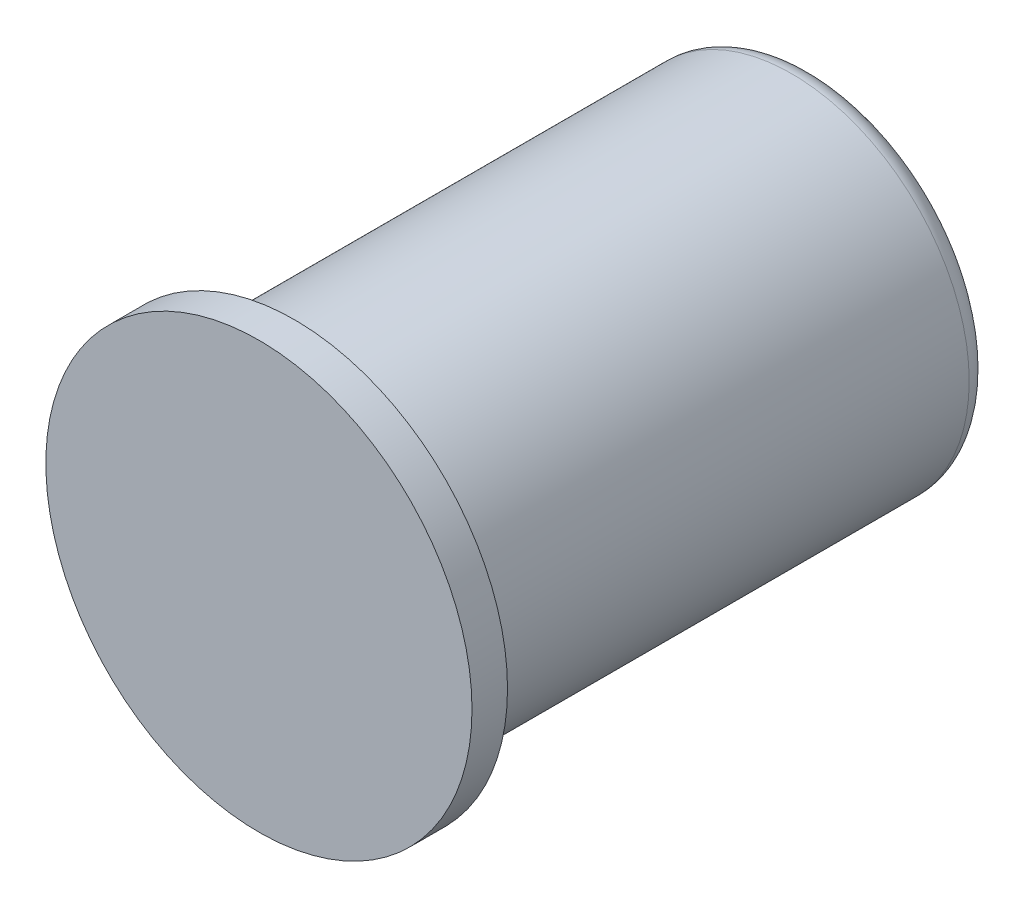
from build123d import *


with BuildPart() as part:
    # Sketch1 → Revolve1 (revolve)
    with BuildSketch(Plane(origin=(0, 0, 0), x_dir=(0, 0, -1), z_dir=(1, 0, 0)), mode=Mode.PRIVATE) as revolve1_sk:
        with BuildLine():
            Line((0, 0), (0, 30))
            Line((0, 30), (5, 30))
            Line((5, 30), (5, 25))
            Line((5, 25), (75, 25))
            ThreePointArc((75, 25), (77.121320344, 24.121320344), (78, 22))
            Line((78, 22), (78, 4.5))
            Line((78, 4.5), (77.5, 4))
            Line((77.5, 4), (69, 4))
            Line((69, 4), (66.690598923, 0))
            Line((66.690598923, 0), (0, 0))
        make_face()
    revolve(revolve1_sk.sketch.rotate(Axis((0, 0, 0), (0, 0, -1)), 90), axis=Axis((0, 0, 0), (0, 0, -1)))


solid = part.part
